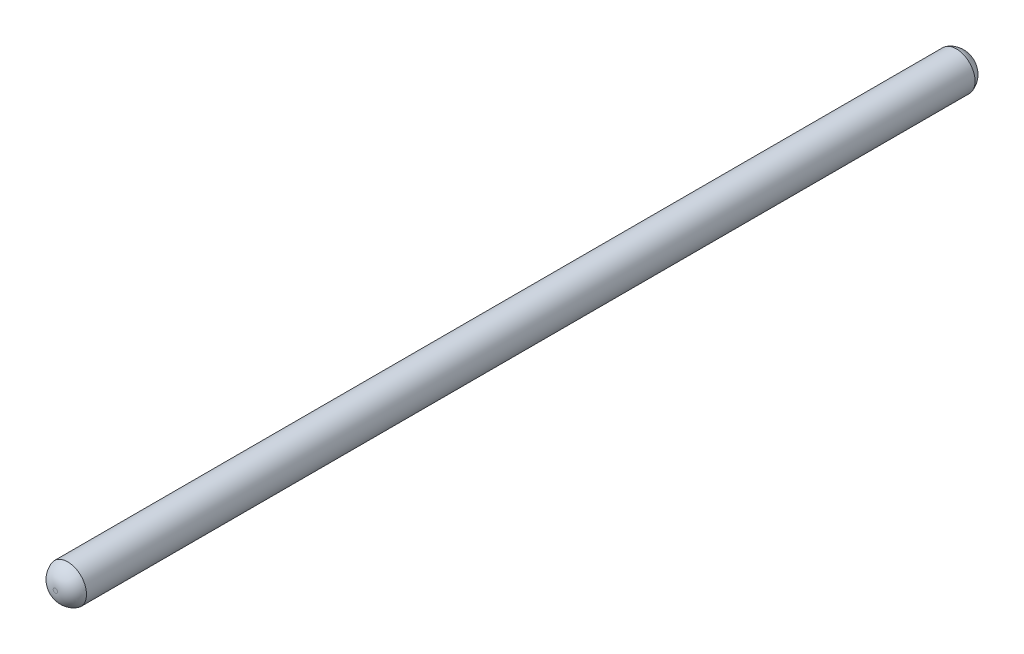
ISO-10303-21;
HEADER;
FILE_DESCRIPTION(('STEP AP214'),'2;1');
FILE_NAME('part.step','',(''),(''),'','','');
FILE_SCHEMA(('AUTOMOTIVE_DESIGN { 1 0 10303 214 1 1 1 1 }'));
ENDSEC;
DATA;
#1=APPLICATION_CONTEXT('core data for automotive mechanical design processes');
#2=APPLICATION_PROTOCOL_DEFINITION('international standard','automotive_design',2000,#1);
#3=PRODUCT_CONTEXT('',#1,'mechanical');
#4=PRODUCT('Part','Part','',(#3));
#5=PRODUCT_RELATED_PRODUCT_CATEGORY('part','',(#4));
#6=PRODUCT_DEFINITION_FORMATION('','',#4);
#7=PRODUCT_DEFINITION_CONTEXT('part definition',#1,'design');
#8=PRODUCT_DEFINITION('design','',#6,#7);
#9=PRODUCT_DEFINITION_SHAPE('','',#8);
#10=(LENGTH_UNIT() NAMED_UNIT(*) SI_UNIT(.MILLI.,.METRE.));
#11=(NAMED_UNIT(*) PLANE_ANGLE_UNIT() SI_UNIT($,.RADIAN.));
#12=(NAMED_UNIT(*) SI_UNIT($,.STERADIAN.) SOLID_ANGLE_UNIT());
#13=UNCERTAINTY_MEASURE_WITH_UNIT(LENGTH_MEASURE(1.E-05),#10,'distance_accuracy_value','');
#14=(GEOMETRIC_REPRESENTATION_CONTEXT(3) GLOBAL_UNCERTAINTY_ASSIGNED_CONTEXT((#13)) GLOBAL_UNIT_ASSIGNED_CONTEXT((#10,
#11,#12)) REPRESENTATION_CONTEXT('',''));
#15=CARTESIAN_POINT('',(0.,0.,0.));
#16=DIRECTION('',(0.,0.,1.));
#17=DIRECTION('',(1.,0.,0.));
#18=AXIS2_PLACEMENT_3D('',#15,#16,#17);
#19=CARTESIAN_POINT('',(0.,0.,-2.00000000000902));
#20=DIRECTION('',(0.,0.,1.));
#21=DIRECTION('',(0.853980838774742,0.520304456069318,0.));
#22=AXIS2_PLACEMENT_3D('',#19,#20,#21);
#23=DEGENERATE_TOROIDAL_SURFACE('',#22,0.750000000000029,6.,.T.);
#24=CARTESIAN_POINT('',(0.,0.,-3.71391365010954));
#25=DIRECTION('',(0.,0.,1.));
#26=DIRECTION('',(0.853980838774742,0.520304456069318,0.));
#27=AXIS2_PLACEMENT_3D('',#24,#25,#26);
#28=CIRCLE('',#27,6.5);
#29=CARTESIAN_POINT('',(5.55087545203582,3.38197896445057,-3.71391365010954));
#30=VERTEX_POINT('',#29);
#31=EDGE_CURVE('E8',#30,#30,#28,.T.);
#32=ORIENTED_EDGE('',*,*,#31,.F.);
#33=EDGE_LOOP('',(#32));
#34=FACE_BOUND('',#33,.T.);
#35=CARTESIAN_POINT('',(0.,0.,-8.00000000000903));
#36=DIRECTION('',(0.,0.,1.));
#37=DIRECTION('',(0.853980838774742,0.520304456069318,0.));
#38=AXIS2_PLACEMENT_3D('',#35,#36,#37);
#39=CIRCLE('',#38,0.750000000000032);
#40=CARTESIAN_POINT('',(0.640485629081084,0.390228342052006,-8.00000000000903));
#41=VERTEX_POINT('',#40);
#42=EDGE_CURVE('E20',#41,#41,#39,.T.);
#43=ORIENTED_EDGE('',*,*,#42,.T.);
#44=EDGE_LOOP('',(#43));
#45=FACE_BOUND('',#44,.T.);
#46=ADVANCED_FACE('F12',(#34,#45),#23,.T.);
#47=CARTESIAN_POINT('',(0.,0.,1.71354762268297));
#48=DIRECTION('',(0.,0.,1.));
#49=DIRECTION('',(0.853980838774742,0.520304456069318,0.));
#50=AXIS2_PLACEMENT_3D('',#47,#48,#49);
#51=CYLINDRICAL_SURFACE('',#50,6.5);
#52=ORIENTED_EDGE('',*,*,#31,.T.);
#53=EDGE_LOOP('',(#52));
#54=FACE_BOUND('',#53,.T.);
#55=CARTESIAN_POINT('',(0.,0.,303.71391365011));
#56=DIRECTION('',(0.,0.,-1.));
#57=DIRECTION('',(-0.988148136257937,0.153503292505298,0.));
#58=AXIS2_PLACEMENT_3D('',#55,#56,#57);
#59=CIRCLE('',#58,6.5);
#60=CARTESIAN_POINT('',(-6.42296288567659,0.997771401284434,303.71391365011));
#61=VERTEX_POINT('',#60);
#62=EDGE_CURVE('E16',#61,#61,#59,.T.);
#63=ORIENTED_EDGE('',*,*,#62,.T.);
#64=EDGE_LOOP('',(#63));
#65=FACE_BOUND('',#64,.T.);
#66=ADVANCED_FACE('F33',(#54,#65),#51,.T.);
#67=CARTESIAN_POINT('',(0.,0.,-8.00000000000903));
#68=DIRECTION('',(0.,0.,1.));
#69=DIRECTION('',(0.853980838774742,0.520304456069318,0.));
#70=AXIS2_PLACEMENT_3D('',#67,#68,#69);
#71=PLANE('',#70);
#72=ORIENTED_EDGE('',*,*,#42,.F.);
#73=EDGE_LOOP('',(#72));
#74=FACE_BOUND('',#73,.T.);
#75=ADVANCED_FACE('F42',(#74),#71,.F.);
#76=CARTESIAN_POINT('',(0.,0.,308.000000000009));
#77=DIRECTION('',(0.,0.,-1.));
#78=DIRECTION('',(-0.988148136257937,0.153503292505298,0.));
#79=AXIS2_PLACEMENT_3D('',#76,#77,#78);
#80=PLANE('',#79);
#81=CARTESIAN_POINT('',(0.,0.,308.000000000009));
#82=DIRECTION('',(0.,0.,-1.));
#83=DIRECTION('',(-0.988148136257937,0.153503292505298,0.));
#84=AXIS2_PLACEMENT_3D('',#81,#82,#83);
#85=CIRCLE('',#84,0.750000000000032);
#86=CARTESIAN_POINT('',(-0.741111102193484,0.115127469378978,308.000000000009));
#87=VERTEX_POINT('',#86);
#88=EDGE_CURVE('E26',#87,#87,#85,.T.);
#89=ORIENTED_EDGE('',*,*,#88,.F.);
#90=EDGE_LOOP('',(#89));
#91=FACE_BOUND('',#90,.T.);
#92=ADVANCED_FACE('F36',(#91),#80,.F.);
#93=CARTESIAN_POINT('',(0.,0.,302.000000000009));
#94=DIRECTION('',(0.,0.,-1.));
#95=DIRECTION('',(-0.988148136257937,0.153503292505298,0.));
#96=AXIS2_PLACEMENT_3D('',#93,#94,#95);
#97=DEGENERATE_TOROIDAL_SURFACE('',#96,0.750000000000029,6.,.T.);
#98=ORIENTED_EDGE('',*,*,#62,.F.);
#99=EDGE_LOOP('',(#98));
#100=FACE_BOUND('',#99,.T.);
#101=ORIENTED_EDGE('',*,*,#88,.T.);
#102=EDGE_LOOP('',(#101));
#103=FACE_BOUND('',#102,.T.);
#104=ADVANCED_FACE('F14',(#100,#103),#97,.T.);
#105=CLOSED_SHELL('',(#46,#66,#75,#92,#104));
#106=MANIFOLD_SOLID_BREP('B1',#105);
#107=ADVANCED_BREP_SHAPE_REPRESENTATION('',(#18,#106),#14);
#108=SHAPE_DEFINITION_REPRESENTATION(#9,#107);
ENDSEC;
END-ISO-10303-21;
